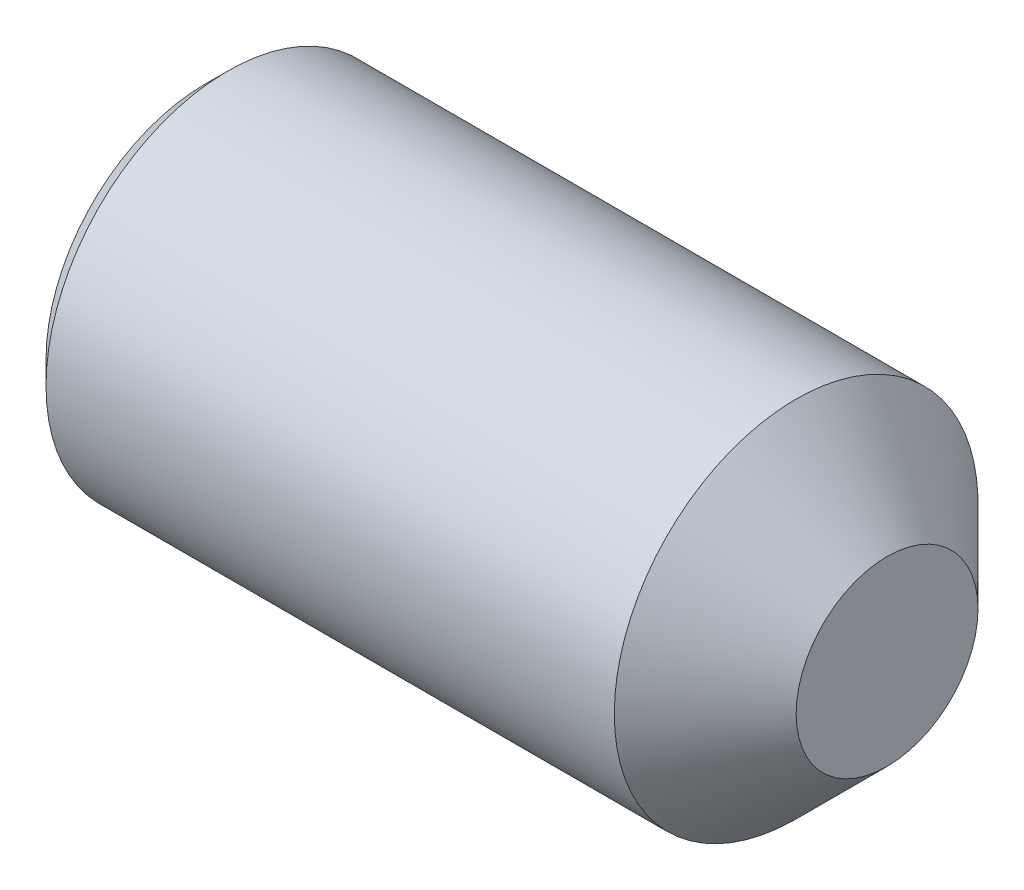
ISO-10303-21;
HEADER;
FILE_DESCRIPTION(('STEP AP214'),'2;1');
FILE_NAME('part.step','',(''),(''),'','','');
FILE_SCHEMA(('AUTOMOTIVE_DESIGN { 1 0 10303 214 1 1 1 1 }'));
ENDSEC;
DATA;
#1=APPLICATION_CONTEXT('core data for automotive mechanical design processes');
#2=APPLICATION_PROTOCOL_DEFINITION('international standard','automotive_design',2000,#1);
#3=PRODUCT_CONTEXT('',#1,'mechanical');
#4=PRODUCT('Part','Part','',(#3));
#5=PRODUCT_RELATED_PRODUCT_CATEGORY('part','',(#4));
#6=PRODUCT_DEFINITION_FORMATION('','',#4);
#7=PRODUCT_DEFINITION_CONTEXT('part definition',#1,'design');
#8=PRODUCT_DEFINITION('design','',#6,#7);
#9=PRODUCT_DEFINITION_SHAPE('','',#8);
#10=(LENGTH_UNIT() NAMED_UNIT(*) SI_UNIT(.MILLI.,.METRE.));
#11=(NAMED_UNIT(*) PLANE_ANGLE_UNIT() SI_UNIT($,.RADIAN.));
#12=(NAMED_UNIT(*) SI_UNIT($,.STERADIAN.) SOLID_ANGLE_UNIT());
#13=UNCERTAINTY_MEASURE_WITH_UNIT(LENGTH_MEASURE(1.E-05),#10,'distance_accuracy_value','');
#14=(GEOMETRIC_REPRESENTATION_CONTEXT(3) GLOBAL_UNCERTAINTY_ASSIGNED_CONTEXT((#13)) GLOBAL_UNIT_ASSIGNED_CONTEXT((#10,
#11,#12)) REPRESENTATION_CONTEXT('',''));
#15=CARTESIAN_POINT('',(0.,0.,0.));
#16=DIRECTION('',(0.,0.,1.));
#17=DIRECTION('',(1.,0.,0.));
#18=AXIS2_PLACEMENT_3D('',#15,#16,#17);
#19=CARTESIAN_POINT('',(0.700000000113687,0.,0.404145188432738));
#20=DIRECTION('',(-1.,0.,0.));
#21=DIRECTION('',(0.,0.,1.));
#22=AXIS2_PLACEMENT_3D('',#19,#20,#21);
#23=PLANE('',#22);
#24=CARTESIAN_POINT('',(0.700000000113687,0.,0.));
#25=DIRECTION('',(-1.,0.,0.));
#26=DIRECTION('',(0.,0.,1.));
#27=AXIS2_PLACEMENT_3D('',#24,#25,#26);
#28=CIRCLE('',#27,0.35);
#29=CARTESIAN_POINT('',(0.700000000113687,0.175,0.303108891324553));
#30=VERTEX_POINT('',#29);
#31=CARTESIAN_POINT('',(0.700000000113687,0.35,0.));
#32=VERTEX_POINT('',#31);
#33=EDGE_CURVE('E48',#30,#32,#28,.T.);
#34=ORIENTED_EDGE('',*,*,#33,.F.);
#35=DIRECTION('',(0.,0.866025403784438,-0.500000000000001));
#36=VECTOR('',#35,1.);
#37=CARTESIAN_POINT('',(0.700000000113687,0.,0.404145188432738));
#38=LINE('',#37,#36);
#39=CARTESIAN_POINT('',(0.700000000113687,0.35,0.202072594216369));
#40=VERTEX_POINT('',#39);
#41=EDGE_CURVE('E237',#30,#40,#38,.T.);
#42=ORIENTED_EDGE('',*,*,#41,.T.);
#43=DIRECTION('',(0.,0.,-1.));
#44=VECTOR('',#43,1.);
#45=CARTESIAN_POINT('',(0.700000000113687,0.35,0.202072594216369));
#46=LINE('',#45,#44);
#47=EDGE_CURVE('E230',#40,#32,#46,.T.);
#48=ORIENTED_EDGE('',*,*,#47,.T.);
#49=EDGE_LOOP('',(#34,#42,#48));
#50=FACE_BOUND('',#49,.T.);
#51=ADVANCED_FACE('F37',(#50),#23,.T.);
#52=CARTESIAN_POINT('',(0.700000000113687,0.175,-0.303108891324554));
#53=VERTEX_POINT('',#52);
#54=EDGE_CURVE('E11',#32,#53,#28,.T.);
#55=ORIENTED_EDGE('',*,*,#54,.F.);
#56=CARTESIAN_POINT('',(0.700000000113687,0.35,-0.202072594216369));
#57=VERTEX_POINT('',#56);
#58=EDGE_CURVE('E233',#32,#57,#46,.T.);
#59=ORIENTED_EDGE('',*,*,#58,.T.);
#60=DIRECTION('',(0.,-0.866025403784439,-0.5));
#61=VECTOR('',#60,1.);
#62=CARTESIAN_POINT('',(0.700000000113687,0.35,-0.202072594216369));
#63=LINE('',#62,#61);
#64=EDGE_CURVE('E226',#57,#53,#63,.T.);
#65=ORIENTED_EDGE('',*,*,#64,.T.);
#66=EDGE_LOOP('',(#55,#59,#65));
#67=FACE_BOUND('',#66,.T.);
#68=ADVANCED_FACE('F124',(#67),#23,.T.);
#69=CARTESIAN_POINT('',(0.700000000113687,-0.175,-0.303108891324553));
#70=VERTEX_POINT('',#69);
#71=EDGE_CURVE('E46',#53,#70,#28,.T.);
#72=ORIENTED_EDGE('',*,*,#71,.F.);
#73=CARTESIAN_POINT('',(0.700000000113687,0.,-0.404145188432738));
#74=VERTEX_POINT('',#73);
#75=EDGE_CURVE('E229',#53,#74,#63,.T.);
#76=ORIENTED_EDGE('',*,*,#75,.T.);
#77=DIRECTION('',(0.,-0.866025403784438,0.5));
#78=VECTOR('',#77,1.);
#79=CARTESIAN_POINT('',(0.700000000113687,0.,-0.404145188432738));
#80=LINE('',#79,#78);
#81=EDGE_CURVE('E222',#74,#70,#80,.T.);
#82=ORIENTED_EDGE('',*,*,#81,.T.);
#83=EDGE_LOOP('',(#72,#76,#82));
#84=FACE_BOUND('',#83,.T.);
#85=ADVANCED_FACE('F129',(#84),#23,.T.);
#86=CARTESIAN_POINT('',(0.700000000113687,-0.35,0.));
#87=VERTEX_POINT('',#86);
#88=EDGE_CURVE('E260',#70,#87,#28,.T.);
#89=ORIENTED_EDGE('',*,*,#88,.F.);
#90=CARTESIAN_POINT('',(0.700000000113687,-0.35,-0.202072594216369));
#91=VERTEX_POINT('',#90);
#92=EDGE_CURVE('E225',#70,#91,#80,.T.);
#93=ORIENTED_EDGE('',*,*,#92,.T.);
#94=DIRECTION('',(0.,0.,1.));
#95=VECTOR('',#94,1.);
#96=CARTESIAN_POINT('',(0.700000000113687,-0.35,-0.202072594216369));
#97=LINE('',#96,#95);
#98=EDGE_CURVE('E193',#91,#87,#97,.T.);
#99=ORIENTED_EDGE('',*,*,#98,.T.);
#100=EDGE_LOOP('',(#89,#93,#99));
#101=FACE_BOUND('',#100,.T.);
#102=ADVANCED_FACE('F268',(#101),#23,.T.);
#103=CARTESIAN_POINT('',(0.700000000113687,-0.175,0.303108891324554));
#104=VERTEX_POINT('',#103);
#105=EDGE_CURVE('E55',#87,#104,#28,.T.);
#106=ORIENTED_EDGE('',*,*,#105,.F.);
#107=CARTESIAN_POINT('',(0.700000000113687,-0.35,0.202072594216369));
#108=VERTEX_POINT('',#107);
#109=EDGE_CURVE('E221',#87,#108,#97,.T.);
#110=ORIENTED_EDGE('',*,*,#109,.T.);
#111=DIRECTION('',(0.,0.866025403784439,0.5));
#112=VECTOR('',#111,1.);
#113=CARTESIAN_POINT('',(0.700000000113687,-0.35,0.202072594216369));
#114=LINE('',#113,#112);
#115=EDGE_CURVE('E238',#108,#104,#114,.T.);
#116=ORIENTED_EDGE('',*,*,#115,.T.);
#117=EDGE_LOOP('',(#106,#110,#116));
#118=FACE_BOUND('',#117,.T.);
#119=ADVANCED_FACE('F122',(#118),#23,.T.);
#120=CARTESIAN_POINT('',(0.,0.7,0.));
#121=DIRECTION('',(1.,0.,0.));
#122=DIRECTION('',(0.,0.,-1.));
#123=AXIS2_PLACEMENT_3D('',#120,#121,#122);
#124=PLANE('',#123);
#125=DIRECTION('',(0.,0.866025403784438,-0.500000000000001));
#126=VECTOR('',#125,1.);
#127=CARTESIAN_POINT('',(1.13686837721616E-10,0.,0.404145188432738));
#128=LINE('',#127,#126);
#129=CARTESIAN_POINT('',(0.,0.,0.404145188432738));
#130=VERTEX_POINT('',#129);
#131=CARTESIAN_POINT('',(1.13686837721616E-10,0.35,0.202072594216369));
#132=VERTEX_POINT('',#131);
#133=EDGE_CURVE('E215',#130,#132,#128,.T.);
#134=ORIENTED_EDGE('',*,*,#133,.F.);
#135=DIRECTION('',(0.,0.866025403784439,0.5));
#136=VECTOR('',#135,1.);
#137=CARTESIAN_POINT('',(1.13686837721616E-10,-0.35,0.202072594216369));
#138=LINE('',#137,#136);
#139=CARTESIAN_POINT('',(1.13686837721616E-10,-0.35,0.202072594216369));
#140=VERTEX_POINT('',#139);
#141=EDGE_CURVE('E63',#140,#130,#138,.T.);
#142=ORIENTED_EDGE('',*,*,#141,.F.);
#143=DIRECTION('',(0.,0.,1.));
#144=VECTOR('',#143,1.);
#145=CARTESIAN_POINT('',(1.13686837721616E-10,-0.35,-0.202072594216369));
#146=LINE('',#145,#144);
#147=CARTESIAN_POINT('',(1.13686837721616E-10,-0.35,-0.202072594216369));
#148=VERTEX_POINT('',#147);
#149=EDGE_CURVE('E202',#148,#140,#146,.T.);
#150=ORIENTED_EDGE('',*,*,#149,.F.);
#151=DIRECTION('',(0.,-0.866025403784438,0.5));
#152=VECTOR('',#151,1.);
#153=CARTESIAN_POINT('',(1.13686837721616E-10,0.,-0.404145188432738));
#154=LINE('',#153,#152);
#155=CARTESIAN_POINT('',(1.13686837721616E-10,0.,-0.404145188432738));
#156=VERTEX_POINT('',#155);
#157=EDGE_CURVE('E206',#156,#148,#154,.T.);
#158=ORIENTED_EDGE('',*,*,#157,.F.);
#159=DIRECTION('',(0.,-0.866025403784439,-0.5));
#160=VECTOR('',#159,1.);
#161=CARTESIAN_POINT('',(1.13686837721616E-10,0.35,-0.202072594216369));
#162=LINE('',#161,#160);
#163=CARTESIAN_POINT('',(1.13686837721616E-10,0.35,-0.202072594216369));
#164=VERTEX_POINT('',#163);
#165=EDGE_CURVE('E209',#164,#156,#162,.T.);
#166=ORIENTED_EDGE('',*,*,#165,.F.);
#167=DIRECTION('',(0.,0.,-1.));
#168=VECTOR('',#167,1.);
#169=CARTESIAN_POINT('',(1.13686837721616E-10,0.35,0.202072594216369));
#170=LINE('',#169,#168);
#171=EDGE_CURVE('E212',#132,#164,#170,.T.);
#172=ORIENTED_EDGE('',*,*,#171,.F.);
#173=EDGE_LOOP('',(#134,#142,#150,#158,#166,#172));
#174=FACE_BOUND('',#173,.T.);
#175=CARTESIAN_POINT('',(0.,0.,0.));
#176=DIRECTION('',(-1.,0.,0.));
#177=DIRECTION('',(0.,0.,1.));
#178=AXIS2_PLACEMENT_3D('',#175,#176,#177);
#179=CIRCLE('',#178,0.7);
#180=CARTESIAN_POINT('',(0.,0.,0.7));
#181=VERTEX_POINT('',#180);
#182=EDGE_CURVE('E183',#181,#181,#179,.T.);
#183=ORIENTED_EDGE('',*,*,#182,.T.);
#184=EDGE_LOOP('',(#183));
#185=FACE_BOUND('',#184,.T.);
#186=ADVANCED_FACE('F39',(#174,#185),#124,.F.);
#187=CARTESIAN_POINT('',(3.,0.,0.));
#188=DIRECTION('',(-1.,0.,0.));
#189=DIRECTION('',(0.,0.,1.));
#190=AXIS2_PLACEMENT_3D('',#187,#188,#189);
#191=PLANE('',#190);
#192=CARTESIAN_POINT('',(3.,0.,0.));
#193=DIRECTION('',(-1.,0.,0.));
#194=DIRECTION('',(0.,0.,1.));
#195=AXIS2_PLACEMENT_3D('',#192,#193,#194);
#196=CIRCLE('',#195,0.4);
#197=CARTESIAN_POINT('',(3.,0.,0.4));
#198=VERTEX_POINT('',#197);
#199=EDGE_CURVE('E41',#198,#198,#196,.T.);
#200=ORIENTED_EDGE('',*,*,#199,.F.);
#201=EDGE_LOOP('',(#200));
#202=FACE_BOUND('',#201,.T.);
#203=ADVANCED_FACE('F165',(#202),#191,.F.);
#204=CARTESIAN_POINT('',(3.,0.,0.));
#205=DIRECTION('',(-1.,0.,0.));
#206=DIRECTION('',(0.,0.,1.));
#207=AXIS2_PLACEMENT_3D('',#204,#205,#206);
#208=CONICAL_SURFACE('',#207,0.4,0.785398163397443);
#209=CARTESIAN_POINT('',(2.6,0.,0.));
#210=DIRECTION('',(-1.,0.,0.));
#211=DIRECTION('',(0.,0.,1.));
#212=AXIS2_PLACEMENT_3D('',#209,#210,#211);
#213=CIRCLE('',#212,0.8);
#214=CARTESIAN_POINT('',(2.6,0.,0.8));
#215=VERTEX_POINT('',#214);
#216=EDGE_CURVE('E177',#215,#215,#213,.T.);
#217=ORIENTED_EDGE('',*,*,#216,.F.);
#218=EDGE_LOOP('',(#217));
#219=FACE_BOUND('',#218,.T.);
#220=ORIENTED_EDGE('',*,*,#199,.T.);
#221=EDGE_LOOP('',(#220));
#222=FACE_BOUND('',#221,.T.);
#223=ADVANCED_FACE('F162',(#219,#222),#208,.T.);
#224=CARTESIAN_POINT('',(-10.7450145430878,0.,0.));
#225=DIRECTION('',(-1.,0.,0.));
#226=DIRECTION('',(0.,0.,1.));
#227=AXIS2_PLACEMENT_3D('',#224,#225,#226);
#228=CYLINDRICAL_SURFACE('',#227,0.8);
#229=CARTESIAN_POINT('',(0.100000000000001,0.,0.));
#230=DIRECTION('',(-1.,0.,0.));
#231=DIRECTION('',(0.,0.,1.));
#232=AXIS2_PLACEMENT_3D('',#229,#230,#231);
#233=CIRCLE('',#232,0.8);
#234=CARTESIAN_POINT('',(0.100000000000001,0.,0.8));
#235=VERTEX_POINT('',#234);
#236=EDGE_CURVE('E179',#235,#235,#233,.T.);
#237=ORIENTED_EDGE('',*,*,#236,.F.);
#238=EDGE_LOOP('',(#237));
#239=FACE_BOUND('',#238,.T.);
#240=ORIENTED_EDGE('',*,*,#216,.T.);
#241=EDGE_LOOP('',(#240));
#242=FACE_BOUND('',#241,.T.);
#243=ADVANCED_FACE('F158',(#239,#242),#228,.T.);
#244=CARTESIAN_POINT('',(0.100000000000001,0.,0.));
#245=DIRECTION('',(1.,0.,0.));
#246=DIRECTION('',(0.,0.,-1.));
#247=AXIS2_PLACEMENT_3D('',#244,#245,#246);
#248=CONICAL_SURFACE('',#247,0.8,0.785398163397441);
#249=ORIENTED_EDGE('',*,*,#182,.F.);
#250=EDGE_LOOP('',(#249));
#251=FACE_BOUND('',#250,.T.);
#252=ORIENTED_EDGE('',*,*,#236,.T.);
#253=EDGE_LOOP('',(#252));
#254=FACE_BOUND('',#253,.T.);
#255=ADVANCED_FACE('F155',(#251,#254),#248,.T.);
#256=CARTESIAN_POINT('',(0.700000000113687,-0.35,0.202072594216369));
#257=DIRECTION('',(0.,-0.5,0.866025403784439));
#258=DIRECTION('',(0.,-0.866025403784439,-0.5));
#259=AXIS2_PLACEMENT_3D('',#256,#257,#258);
#260=PLANE('',#259);
#261=ORIENTED_EDGE('',*,*,#141,.T.);
#262=DIRECTION('',(-1.,0.,0.));
#263=VECTOR('',#262,1.);
#264=CARTESIAN_POINT('',(0.700000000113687,0.,0.404145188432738));
#265=LINE('',#264,#263);
#266=CARTESIAN_POINT('',(0.700000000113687,0.,0.404145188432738));
#267=VERTEX_POINT('',#266);
#268=EDGE_CURVE('E190',#267,#130,#265,.T.);
#269=ORIENTED_EDGE('',*,*,#268,.F.);
#270=EDGE_CURVE('E205',#104,#267,#114,.T.);
#271=ORIENTED_EDGE('',*,*,#270,.F.);
#272=ORIENTED_EDGE('',*,*,#115,.F.);
#273=DIRECTION('',(-1.,0.,0.));
#274=VECTOR('',#273,1.);
#275=CARTESIAN_POINT('',(0.700000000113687,-0.35,0.202072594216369));
#276=LINE('',#275,#274);
#277=EDGE_CURVE('E189',#108,#140,#276,.T.);
#278=ORIENTED_EDGE('',*,*,#277,.T.);
#279=EDGE_LOOP('',(#261,#269,#271,#272,#278));
#280=FACE_BOUND('',#279,.T.);
#281=ADVANCED_FACE('F137',(#280),#260,.F.);
#282=CARTESIAN_POINT('',(0.700000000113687,-0.35,-0.202072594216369));
#283=DIRECTION('',(0.,-1.,0.));
#284=DIRECTION('',(0.,0.,-1.));
#285=AXIS2_PLACEMENT_3D('',#282,#283,#284);
#286=PLANE('',#285);
#287=ORIENTED_EDGE('',*,*,#149,.T.);
#288=ORIENTED_EDGE('',*,*,#277,.F.);
#289=ORIENTED_EDGE('',*,*,#109,.F.);
#290=ORIENTED_EDGE('',*,*,#98,.F.);
#291=DIRECTION('',(-1.,0.,0.));
#292=VECTOR('',#291,1.);
#293=CARTESIAN_POINT('',(0.700000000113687,-0.35,-0.202072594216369));
#294=LINE('',#293,#292);
#295=EDGE_CURVE('E199',#91,#148,#294,.T.);
#296=ORIENTED_EDGE('',*,*,#295,.T.);
#297=EDGE_LOOP('',(#287,#288,#289,#290,#296));
#298=FACE_BOUND('',#297,.T.);
#299=ADVANCED_FACE('F133',(#298),#286,.F.);
#300=CARTESIAN_POINT('',(0.700000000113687,0.,-0.404145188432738));
#301=DIRECTION('',(0.,-0.5,-0.866025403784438));
#302=DIRECTION('',(0.,0.866025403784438,-0.5));
#303=AXIS2_PLACEMENT_3D('',#300,#301,#302);
#304=PLANE('',#303);
#305=ORIENTED_EDGE('',*,*,#157,.T.);
#306=ORIENTED_EDGE('',*,*,#295,.F.);
#307=ORIENTED_EDGE('',*,*,#92,.F.);
#308=ORIENTED_EDGE('',*,*,#81,.F.);
#309=DIRECTION('',(-1.,0.,0.));
#310=VECTOR('',#309,1.);
#311=CARTESIAN_POINT('',(0.700000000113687,0.,-0.404145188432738));
#312=LINE('',#311,#310);
#313=EDGE_CURVE('E197',#74,#156,#312,.T.);
#314=ORIENTED_EDGE('',*,*,#313,.T.);
#315=EDGE_LOOP('',(#305,#306,#307,#308,#314));
#316=FACE_BOUND('',#315,.T.);
#317=ADVANCED_FACE('F136',(#316),#304,.F.);
#318=CARTESIAN_POINT('',(0.700000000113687,0.35,-0.202072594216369));
#319=DIRECTION('',(0.,0.5,-0.866025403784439));
#320=DIRECTION('',(0.,0.866025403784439,0.5));
#321=AXIS2_PLACEMENT_3D('',#318,#319,#320);
#322=PLANE('',#321);
#323=ORIENTED_EDGE('',*,*,#165,.T.);
#324=ORIENTED_EDGE('',*,*,#313,.F.);
#325=ORIENTED_EDGE('',*,*,#75,.F.);
#326=ORIENTED_EDGE('',*,*,#64,.F.);
#327=DIRECTION('',(-1.,0.,0.));
#328=VECTOR('',#327,1.);
#329=CARTESIAN_POINT('',(0.700000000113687,0.35,-0.202072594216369));
#330=LINE('',#329,#328);
#331=EDGE_CURVE('E195',#57,#164,#330,.T.);
#332=ORIENTED_EDGE('',*,*,#331,.T.);
#333=EDGE_LOOP('',(#323,#324,#325,#326,#332));
#334=FACE_BOUND('',#333,.T.);
#335=ADVANCED_FACE('F141',(#334),#322,.F.);
#336=CARTESIAN_POINT('',(0.700000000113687,0.35,0.202072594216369));
#337=DIRECTION('',(0.,1.,0.));
#338=DIRECTION('',(0.,0.,1.));
#339=AXIS2_PLACEMENT_3D('',#336,#337,#338);
#340=PLANE('',#339);
#341=ORIENTED_EDGE('',*,*,#171,.T.);
#342=ORIENTED_EDGE('',*,*,#331,.F.);
#343=ORIENTED_EDGE('',*,*,#58,.F.);
#344=ORIENTED_EDGE('',*,*,#47,.F.);
#345=DIRECTION('',(-1.,0.,0.));
#346=VECTOR('',#345,1.);
#347=CARTESIAN_POINT('',(0.700000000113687,0.35,0.202072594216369));
#348=LINE('',#347,#346);
#349=EDGE_CURVE('E192',#40,#132,#348,.T.);
#350=ORIENTED_EDGE('',*,*,#349,.T.);
#351=EDGE_LOOP('',(#341,#342,#343,#344,#350));
#352=FACE_BOUND('',#351,.T.);
#353=ADVANCED_FACE('F145',(#352),#340,.F.);
#354=CARTESIAN_POINT('',(0.700000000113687,0.,0.404145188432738));
#355=DIRECTION('',(0.,0.500000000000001,0.866025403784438));
#356=DIRECTION('',(0.,-0.866025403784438,0.500000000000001));
#357=AXIS2_PLACEMENT_3D('',#354,#355,#356);
#358=PLANE('',#357);
#359=ORIENTED_EDGE('',*,*,#133,.T.);
#360=ORIENTED_EDGE('',*,*,#349,.F.);
#361=ORIENTED_EDGE('',*,*,#41,.F.);
#362=EDGE_CURVE('E234',#267,#30,#38,.T.);
#363=ORIENTED_EDGE('',*,*,#362,.F.);
#364=ORIENTED_EDGE('',*,*,#268,.T.);
#365=EDGE_LOOP('',(#359,#360,#361,#363,#364));
#366=FACE_BOUND('',#365,.T.);
#367=ADVANCED_FACE('F119',(#366),#358,.F.);
#368=EDGE_CURVE('E176',#104,#30,#28,.T.);
#369=ORIENTED_EDGE('',*,*,#368,.F.);
#370=ORIENTED_EDGE('',*,*,#270,.T.);
#371=ORIENTED_EDGE('',*,*,#362,.T.);
#372=EDGE_LOOP('',(#369,#370,#371));
#373=FACE_BOUND('',#372,.T.);
#374=ADVANCED_FACE('F114',(#373),#23,.T.);
#375=CARTESIAN_POINT('',(0.902072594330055,0.,0.));
#376=DIRECTION('',(-1.,0.,0.));
#377=DIRECTION('',(0.,0.,1.));
#378=AXIS2_PLACEMENT_3D('',#375,#376,#377);
#379=CONICAL_SURFACE('',#378,0.,1.0471975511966);
#380=ORIENTED_EDGE('',*,*,#33,.T.);
#381=ORIENTED_EDGE('',*,*,#54,.T.);
#382=ORIENTED_EDGE('',*,*,#71,.T.);
#383=ORIENTED_EDGE('',*,*,#88,.T.);
#384=ORIENTED_EDGE('',*,*,#105,.T.);
#385=ORIENTED_EDGE('',*,*,#368,.T.);
#386=EDGE_LOOP('',(#380,#381,#382,#383,#384,#385));
#387=FACE_BOUND('',#386,.T.);
#388=CARTESIAN_POINT('',(0.902072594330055,0.,0.));
#389=VERTEX_POINT('',#388);
#390=VERTEX_LOOP('',#389);
#391=FACE_BOUND('',#390,.T.);
#392=ADVANCED_FACE('F112',(#387,#391),#379,.F.);
#393=CLOSED_SHELL('',(#51,#68,#85,#102,#119,#186,#203,#223,#243,#255,#281,#299,#317,#335,#353,
#367,#374,#392));
#394=MANIFOLD_SOLID_BREP('B2',#393);
#395=ADVANCED_BREP_SHAPE_REPRESENTATION('',(#18,#394),#14);
#396=SHAPE_DEFINITION_REPRESENTATION(#9,#395);
ENDSEC;
END-ISO-10303-21;
